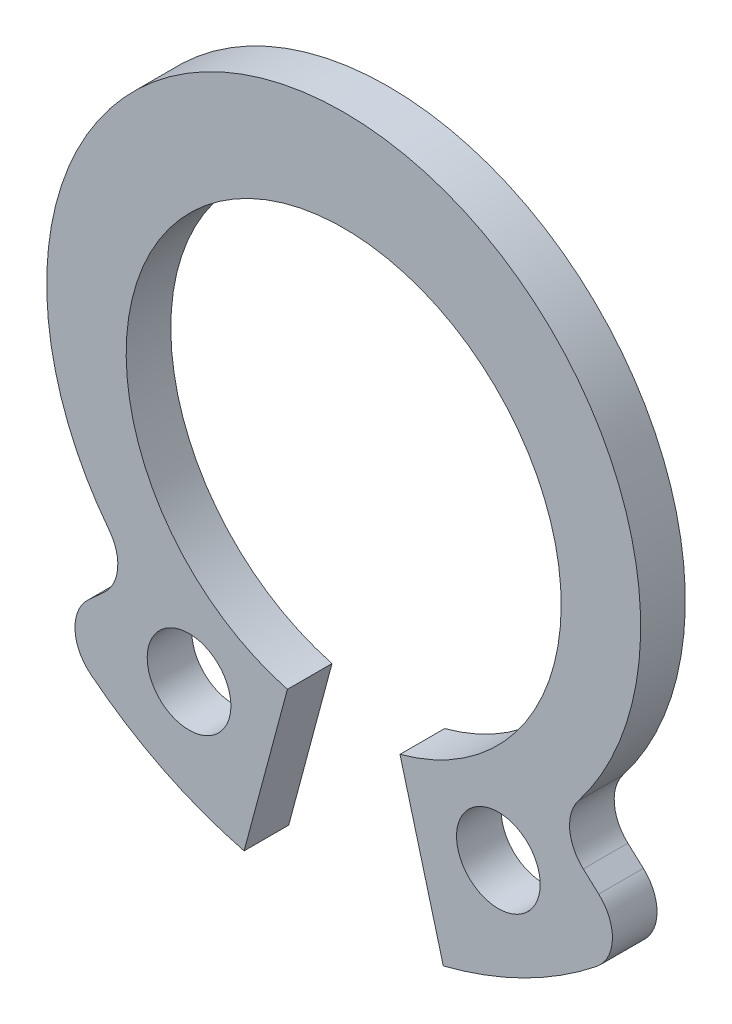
from build123d import *

# Parameters (mm, degrees)
ESQUISSE1_R          = 0.75
BASE_EXTRUSION_DEPTH = 0.8


with BuildPart() as part:
    # Esquisse1 → Base-Extrusion (new body)
    with BuildSketch(Plane.XY):
        with BuildLine():
            Line((4.295493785, -3.903800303), (4.572793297, -4.155813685))
            ThreePointArc((4.572793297, -4.155813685), (4.81800161, -4.734450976), (4.536873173, -5.296514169))
            ThreePointArc((4.536873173, -5.296514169), (3.234551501, -6.12784305), (1.785851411, -6.664888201))
            Line((1.785851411, -6.664888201), (1.009394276, -3.767110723))
            ThreePointArc((1.009394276, -3.767110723), (0, 3.9), (-1.009394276, -3.767110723))
            Line((-1.009394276, -3.767110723), (-1.785851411, -6.664888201))
            ThreePointArc((-1.785851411, -6.664888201), (-3.234551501, -6.12784305), (-4.536873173, -5.296514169))
            ThreePointArc((-4.536873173, -5.296514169), (-4.81800161, -4.734450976), (-4.572793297, -4.155813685))
            Line((-4.572793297, -4.155813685), (-4.295493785, -3.903800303))
            ThreePointArc((-4.295493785, -3.903800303), (-4.052728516, -3.41368379), (-4.207331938, -2.889043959))
            ThreePointArc((-4.207331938, -2.889043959), (0, 5.7), (4.207331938, -2.889043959))
            ThreePointArc((4.207331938, -2.889043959), (4.052728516, -3.41368379), (4.295493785, -3.903800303))
        make_face()
        with Locations((2.773133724, -4.531812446)):
            Circle(ESQUISSE1_R, mode=Mode.SUBTRACT)
        with Locations(Location((-2.773133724, -4.531812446, 0), (0, 0, 180))):
            Circle(ESQUISSE1_R, mode=Mode.SUBTRACT)
    extrude(amount=BASE_EXTRUSION_DEPTH)


solid = part.part
